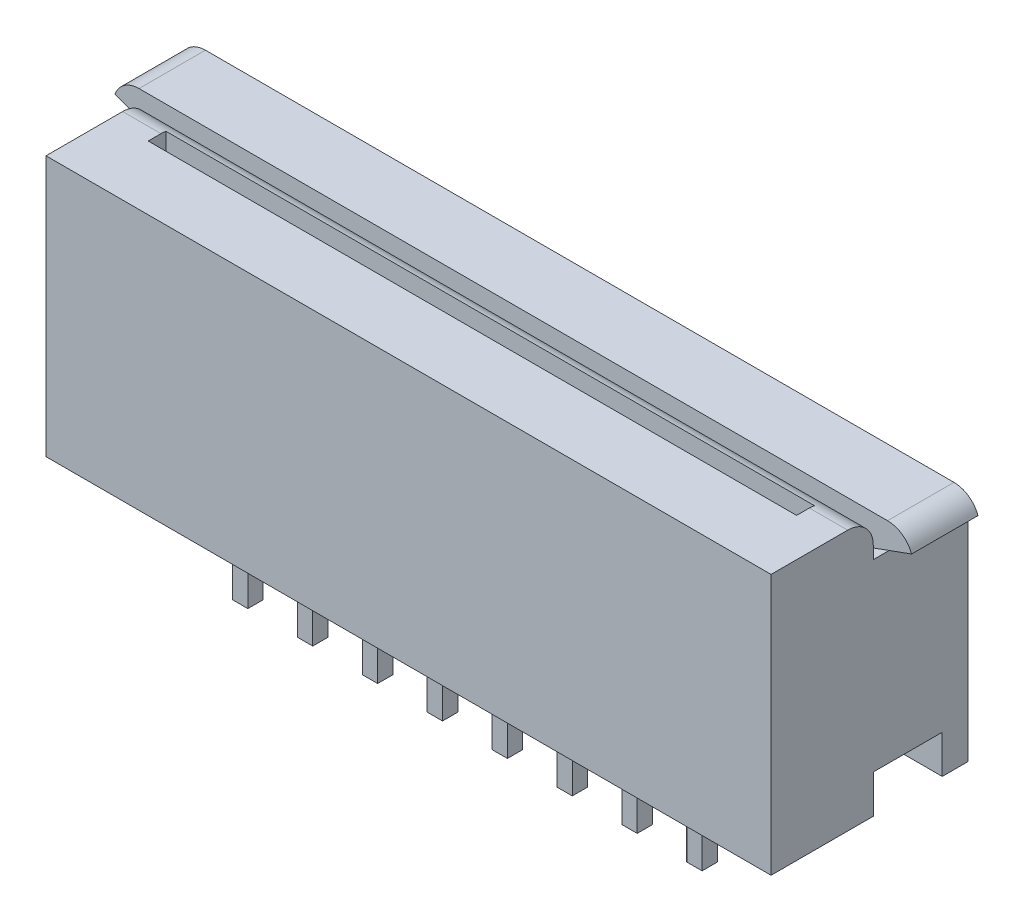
from build123d import *

# Parameters (mm, degrees)
EXTRUDE_1_DEPTH        = 23.08
EXTRUDE_1_DEPTH_BACK   = 5.3
SKETCH_2_W             = 25.78
SKETCH_2_H             = 2.6
EXTRUDE_2_DEPTH        = 1.5
EXTRUDE_3_DEPTH        = 2.6
SKETCH_4_W             = 25.38
SKETCH_4_H             = 0.7
CUT_EXTRUDE_1_DEPTH    = 4
SKETCH_5_W             = 0.6
SKETCH_5_H             = 0.6
EXTRUDE_4_DEPTH        = 3.5
PATTERN_LINEAR_1_COUNT = 8
PATTERN_LINEAR_1_PITCH = 2.54
SKETCH_6_R             = 0.75
EXTRUDE_5_DEPTH        = 1.5
FILLET_1_R             = 0.5


with BuildPart() as part:
    # Sketch 1 → Extrude 1 (new, two sides: drawn at the far end of the back side and taken through both)
    with BuildSketch(Plane(origin=(0, 0, 0), x_dir=(0, 0, -1), z_dir=(1, 0, 0)).offset(-EXTRUDE_1_DEPTH_BACK)):
        with BuildLine():
            Line((-2.6, 0), (1.4, 0))
            Line((1.4, 0), (1.4, 1.5))
            Line((1.4, 1.5), (4.1, 1.5))
            Line((4.1, 1.5), (4.1, 0))
            Line((4.1, 0), (5.1, 0))
            Line((5.1, 0), (5.1, 8.7))
            Line((5.1, 8.7), (1.4, 8.7))
            Line((1.4, 8.7), (1.4, 9.2))
            ThreePointArc((1.4, 9.2), (1.107106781, 9.907106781), (0.4, 10.2))
            Line((0.4, 10.2), (-2.6, 10.2))
            Line((-2.6, 10.2), (-2.6, 0))
        make_face()
    extrude(amount=EXTRUDE_1_DEPTH + EXTRUDE_1_DEPTH_BACK)

    # Sketch 2 → Extrude 2 (add)
    with BuildSketch(Plane(origin=(0, 8.7, 0), x_dir=(-1, 0, 0), z_dir=(0, 1, 0))):
        with Locations((-8.89, -2.8)):
            Rectangle(SKETCH_2_W, SKETCH_2_H)
    extrude(amount=EXTRUDE_2_DEPTH)

    # Sketch 3 → Extrude 3 (add)
    with BuildSketch(Plane.XY.offset(-1.5)):
        with BuildLine():
            Line((21.78, 10.2), (23.539774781, 10.2))
            ThreePointArc((23.539774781, 10.2), (24.113676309, 10.019049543), (24.48, 9.541647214))
            Line((24.48, 9.541647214), (22.908989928, 8.96984631))
            ThreePointArc((22.908989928, 8.96984631), (22.670423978, 8.786788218), (22.58, 8.5))
            Line((22.58, 8.5), (22.58, 7.7))
            Line((22.58, 7.7), (21.78, 7.7))
            Line((21.78, 7.7), (21.78, 10.2))
        make_face()
        with BuildLine():
            Line((-4, 10.2), (-5.759774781, 10.2))
            ThreePointArc((-5.759774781, 10.2), (-6.333676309, 10.019049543), (-6.7, 9.541647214))
            Line((-6.7, 9.541647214), (-4.8, 8.850103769))
            Line((-4.8, 8.850103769), (-4.8, 7.7))
            Line((-4.8, 7.7), (-4, 7.7))
            Line((-4, 7.7), (-4, 10.2))
        make_face()
    extrude(amount=-EXTRUDE_3_DEPTH)

    # Sketch 4 → Cut-Extrude 1 (cut)
    with BuildSketch(Plane(origin=(0, 10.2, 0), x_dir=(-1, 0, 0), z_dir=(0, 1, 0))):
        with Locations((-8.89, -0.25)):
            Rectangle(SKETCH_4_W, SKETCH_4_H)
    extrude(amount=-CUT_EXTRUDE_1_DEPTH, mode=Mode.SUBTRACT)

    # Sketch 5 → Extrude 4 (add)
    with BuildSketch(Plane.XZ):
        Rectangle(SKETCH_5_W, SKETCH_5_H)
    extrude_4 = extrude(amount=EXTRUDE_4_DEPTH)

    # Pattern Linear 1: Extrude 4 ×8
    with Locations(*[(i * PATTERN_LINEAR_1_PITCH, 0, 0) for i in range(1, PATTERN_LINEAR_1_COUNT)]):
        add(extrude_4)

    # Sketch 6 → Extrude 5 (add)
    with BuildSketch(Plane.XZ):
        with Locations(Location((-2.54, 0, 0), (0, 0, 90))):
            Circle(SKETCH_6_R)
    extrude(amount=EXTRUDE_5_DEPTH)

    # Fillet 1
    fillet_1_edges = [part.edges().sort_by_distance(p)[0] for p in [
        (-2.54, -1.5, -0.75),
    ]]
    fillet(fillet_1_edges, radius=FILLET_1_R)


solid = part.part
